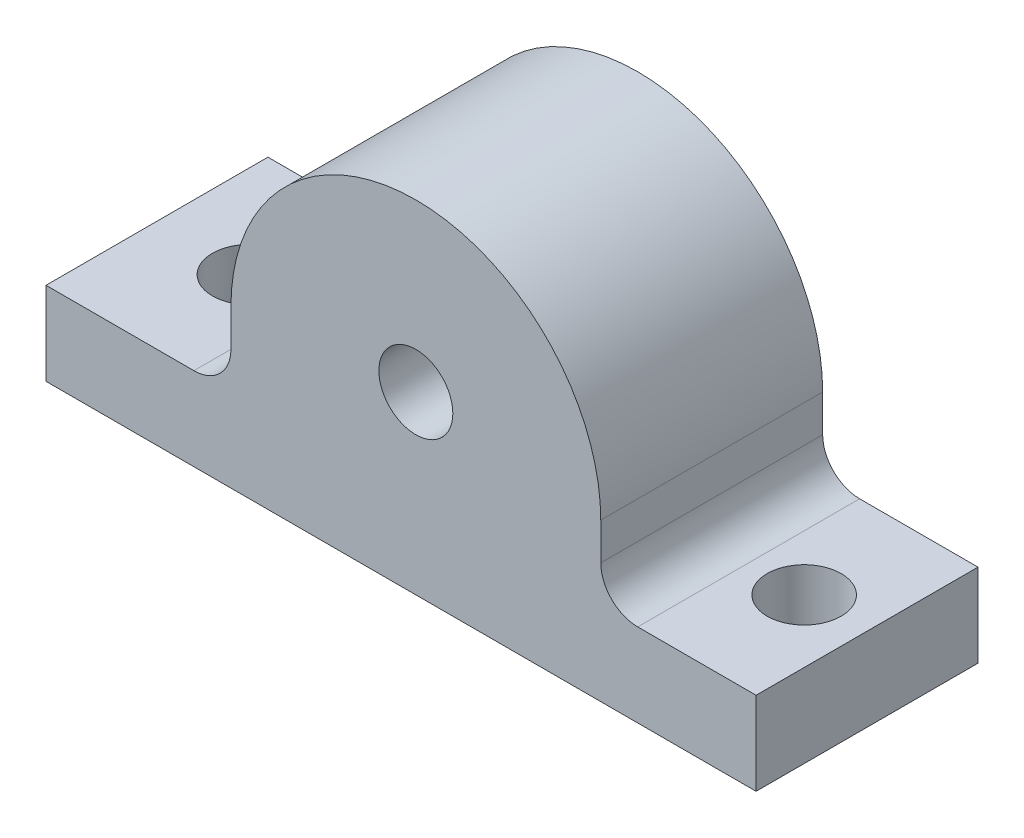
from build123d import *

# Parameters (mm, degrees)
SKETCH1_W                  = 121.92
SKETCH1_H                  = 38.1
BOSS_EXTRUDE1_DEPTH        = 14.2875
SKETCH2_W                  = 63.5
SKETCH2_H                  = 38.1
BOSS_EXTRUDE2_DEPTH        = 44.45
F_1_2_0_5_DIAMETER_HOLE1_D = 12.7
F_1_2_0_5_DIAMETER_HOLE2_D = 12.7
FILLET1_R                  = 6.35
FILLET2_RADIUS             = 31.75
FILLET2_LENGTH             = 38.1


with BuildPart() as part:
    # Sketch1 → Boss-Extrude1 (new body)
    with BuildSketch(Plane(origin=(0, 0, 0), x_dir=(1, 0, 0), z_dir=(0, 1, 0))):
        with Locations((60.96, 19.05)):
            Rectangle(SKETCH1_W, SKETCH1_H)
    extrude(amount=BOSS_EXTRUDE1_DEPTH)

    # Sketch2 → Boss-Extrude2 (add)
    with BuildSketch(Plane(origin=(0, 14.2875, 0), x_dir=(1, 0, 0), z_dir=(0, 1, 0))):
        with Locations((63.5, 19.05)):
            Rectangle(SKETCH2_W, SKETCH2_H)
    extrude(amount=BOSS_EXTRUDE2_DEPTH)

    # 1_2 _0.5_ Diameter Hole1 (through all)
    with Locations(Plane(origin=(0, 58.7375, 0), x_dir=(1, 0, 0), z_dir=(0, 1, 0))):
        with Locations((15.875, 19.05), (111.125, 19.05)):
            Hole(F_1_2_0_5_DIAMETER_HOLE1_D / 2)

    # 1_2 _0.5_ Diameter Hole2 (through all)
    with Locations(Plane.XY):
        with Locations((63.5, 30.1625)):
            Hole(F_1_2_0_5_DIAMETER_HOLE2_D / 2)

    # Fillet1
    fillet1_edges = [part.edges().sort_by_distance(p)[0] for p in [
        (31.75, 14.2875, -19.05),
        (95.25, 14.2875, -19.05),
    ]]
    fillet(fillet1_edges, radius=FILLET1_R)

    # Fillet2: full round fillet: the end face becomes a half cylinder, R = half its width
    fillet2_face = Plane((63.5, 58.7375, -19.05), x_dir=(0, 0, 1), z_dir=(0, 1, 0))  # on the end face: x along it, z out of the body
    fillet2_slab = fillet2_face.offset(-FILLET2_RADIUS / 2) * Box(FILLET2_LENGTH, 2 * FILLET2_RADIUS, FILLET2_RADIUS, mode=Mode.PRIVATE)  # the body's end, R deep
    fillet2_round = Plane((63.5, 26.9875, -19.05), x_dir=(0, 1, 0), z_dir=(0, 0, 1)) * Cylinder(FILLET2_RADIUS, FILLET2_LENGTH, mode=Mode.PRIVATE)  # its axis R under the face
    add(fillet2_slab - fillet2_round, mode=Mode.SUBTRACT)


solid = part.part
